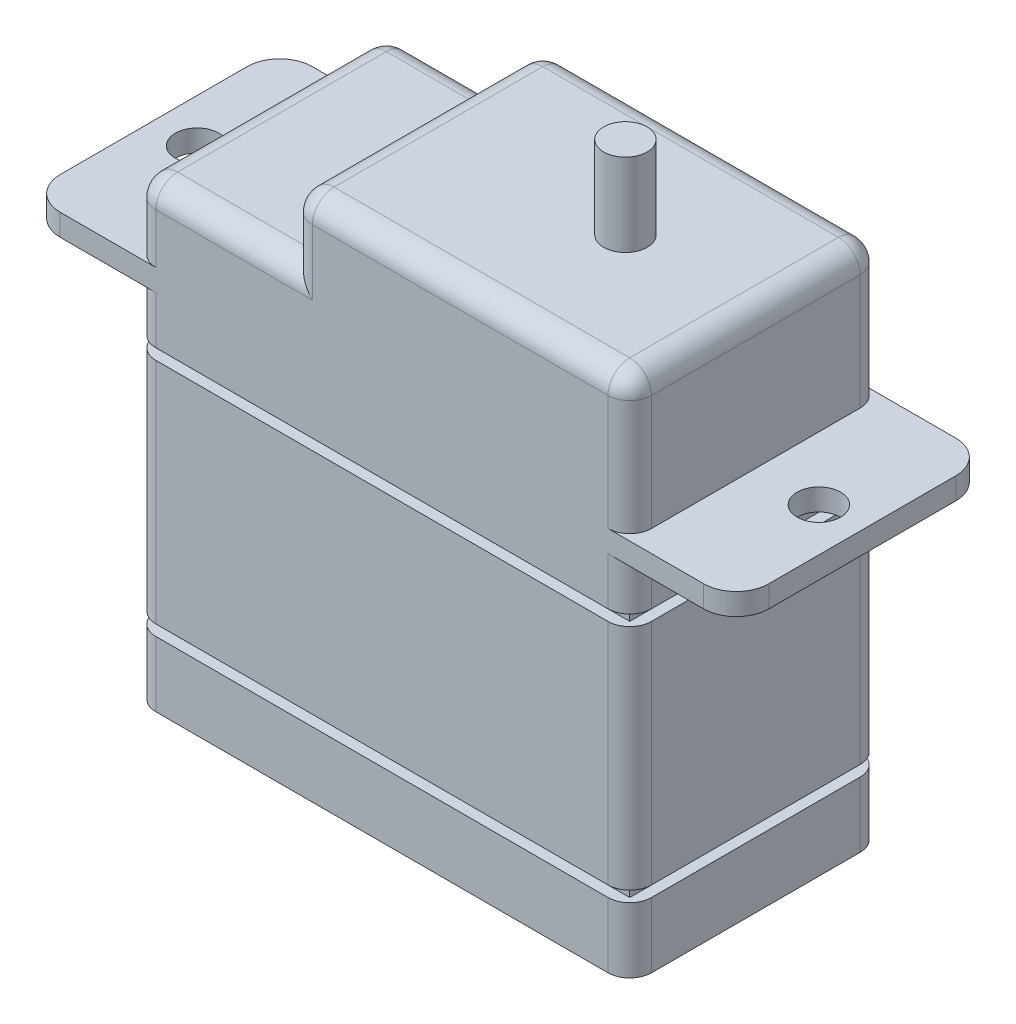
from build123d import *

# Parameters (mm, degrees)
LINEAR_AUSTRAGEN1_DEPTH         = 11.6
SKIZZE4_OUTSIDE_W               = 31.816
SKIZZE4_OUTSIDE_H               = 20.616
SKIZZE4_OUTSIDE_W_2             = 21.8
SKIZZE4_OUTSIDE_H_2             = 10.6
SCHNITT_LINEAR_AUSTRAGEN2_DEPTH = 0.5
SKIZZE5_OUTSIDE_W               = 31.816
SKIZZE5_OUTSIDE_H               = 20.616
SKIZZE5_OUTSIDE_W_2             = 21.8
SKIZZE5_OUTSIDE_H_2             = 10.6
SCHNITT_LINEAR_AUSTRAGEN3_DEPTH = 0.5
SKIZZE6_R                       = 1
LINEAR_AUSTRAGEN2_DEPTH         = 1
VERRUNDUNG2_R                   = 1
SKIZZE7_R                       = 1
LINEAR_AUSTRAGEN3_DEPTH         = 3.8


with BuildPart() as part:
    # Skizze1 → Linear austragen1 (new body)
    with BuildSketch(Plane.XY):
        Polygon((0, 21), (7.2, 21), (7.2, 24), (22.8, 24), (22.8, 0), (0, 0), align=None)
    extrude(amount=LINEAR_AUSTRAGEN1_DEPTH)

    # Skizze4 outside → Schnitt-Linear austragen2 (cut)
    with BuildSketch(Plane.XZ.offset(-3)):
        with Locations((11.4, 5.8)):
            Rectangle(SKIZZE4_OUTSIDE_W, SKIZZE4_OUTSIDE_H)
        with Locations((11.4, 5.8)):
            Rectangle(SKIZZE4_OUTSIDE_W_2, SKIZZE4_OUTSIDE_H_2, mode=Mode.SUBTRACT)
    extrude(amount=-SCHNITT_LINEAR_AUSTRAGEN2_DEPTH, mode=Mode.SUBTRACT)

    # Skizze5 outside → Schnitt-Linear austragen3 (cut)
    with BuildSketch(Plane.XZ.offset(-14)):
        with Locations((11.4, 5.8)):
            Rectangle(SKIZZE5_OUTSIDE_W, SKIZZE5_OUTSIDE_H)
        with Locations((11.4, 5.8)):
            Rectangle(SKIZZE5_OUTSIDE_W_2, SKIZZE5_OUTSIDE_H_2, mode=Mode.SUBTRACT)
    extrude(amount=-SCHNITT_LINEAR_AUSTRAGEN3_DEPTH, mode=Mode.SUBTRACT)

    # Skizze6 → Linear austragen2 (add)
    # profile 1 of 2: a face of its own
    with BuildSketch(Plane.XZ.offset(-16.7)):
        with BuildLine():
            Line((0, 11.6), (-3.4, 11.6))
            ThreePointArc((-3.4, 11.6), (-4.460660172, 11.160660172), (-4.9, 10.1))
            Line((-4.9, 10.1), (-4.9, 1.5))
            ThreePointArc((-4.9, 1.5), (-4.460660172, 0.439339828), (-3.4, 0))
            Line((-3.4, 0), (0, 0))
            Line((0, 0), (0, 11.6))
        make_face()
        with Locations(Location((-2.9, 5.8, 0), (0, 0, 270))):
            Circle(SKIZZE6_R, mode=Mode.SUBTRACT)
    # profile 2 of 2: a face of its own
    with BuildSketch(Plane.XZ.offset(-16.7)):
        with BuildLine():
            Line((22.8, 0), (26.2, 0))
            ThreePointArc((26.2, 0), (27.260660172, 0.439339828), (27.7, 1.5))
            Line((27.7, 1.5), (27.7, 10.1))
            ThreePointArc((27.7, 10.1), (27.260660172, 11.160660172), (26.2, 11.6))
            Line((26.2, 11.6), (22.8, 11.6))
            Line((22.8, 11.6), (22.8, 0))
        make_face()
        with Locations(Location((25.7, 5.8, 0), (0, 0, 270))):
            Circle(SKIZZE6_R, mode=Mode.SUBTRACT)
    extrude(amount=-LINEAR_AUSTRAGEN2_DEPTH)

    # Verrundung2
    verrundung2_edges = [part.edges().sort_by_distance(p)[0] for p in [
        (22.8, 1.5, 11.6),
        (7.2, 24, 5.8),
        (22.8, 24, 5.8),
        (15, 24, 11.6),
        (7.2, 22.5, 11.6),
        (0, 1.5, 0),
        (22.8, 8.75, 0),
        (3.6, 21, 11.6),
        (0, 1.5, 11.6),
        (22.8, 8.75, 11.6),
        (0, 19.35, 11.6),
        (22.8, 15.6, 0),
        (0, 8.75, 0),
        (22.8, 15.6, 11.6),
        (0, 8.75, 11.6),
        (3.6, 21, 0),
        (7.2, 22.5, 0),
        (15, 24, 0),
        (22.8, 1.5, 0),
        (0, 19.35, 0),
        (0, 15.6, 11.6),
        (0, 15.6, 0),
        (0, 21, 5.8),
        (22.8, 20.85, 0),
        (22.8, 20.85, 11.6),
    ]]
    fillet(verrundung2_edges, radius=VERRUNDUNG2_R)

    # Skizze7 → Linear austragen3 (add)
    with BuildSketch(Plane(origin=(0, 24, 0), x_dir=(-1, 0, 0), z_dir=(0, 1, 0))):
        with Locations(Location((-16.8, 5.8, 0), (0, 0, 270))):
            Circle(SKIZZE7_R)
    extrude(amount=LINEAR_AUSTRAGEN3_DEPTH)


solid = part.part
